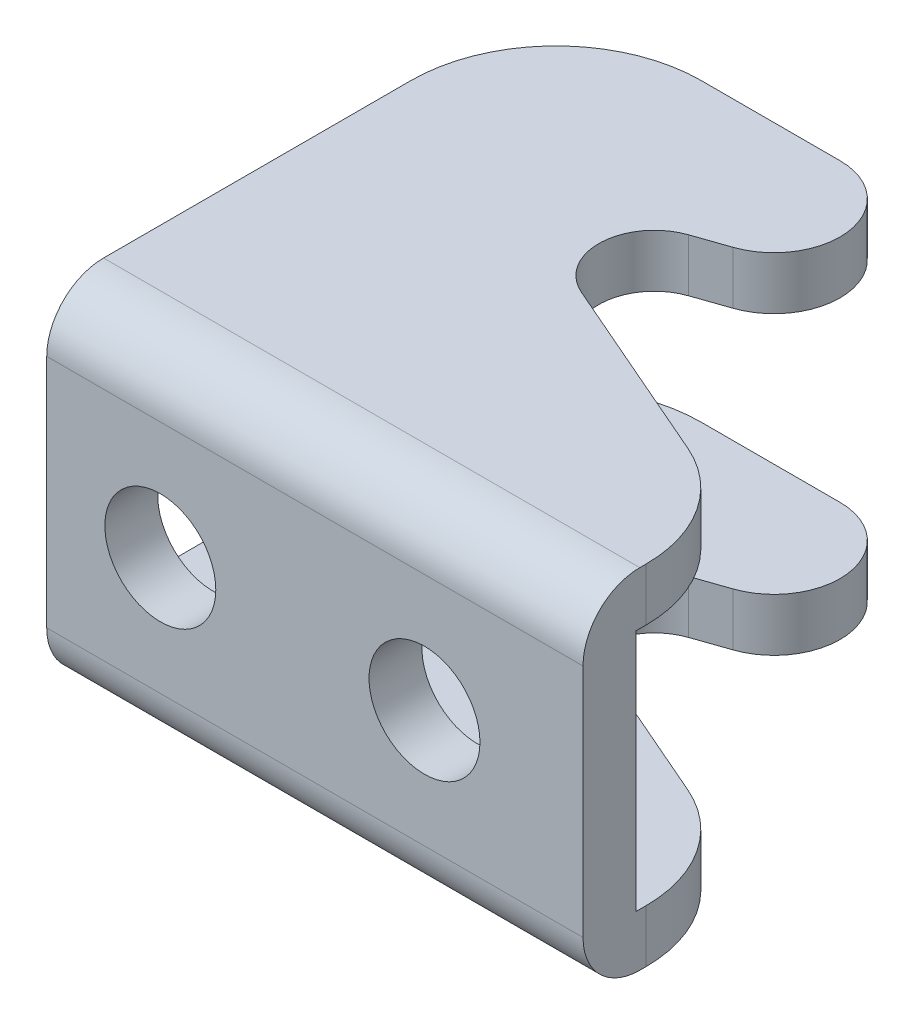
ISO-10303-21;
HEADER;
FILE_DESCRIPTION(('STEP AP214'),'2;1');
FILE_NAME('part.step','',(''),(''),'','','');
FILE_SCHEMA(('AUTOMOTIVE_DESIGN { 1 0 10303 214 1 1 1 1 }'));
ENDSEC;
DATA;
#1=APPLICATION_CONTEXT('core data for automotive mechanical design processes');
#2=APPLICATION_PROTOCOL_DEFINITION('international standard','automotive_design',2000,#1);
#3=PRODUCT_CONTEXT('',#1,'mechanical');
#4=PRODUCT('Part','Part','',(#3));
#5=PRODUCT_RELATED_PRODUCT_CATEGORY('part','',(#4));
#6=PRODUCT_DEFINITION_FORMATION('','',#4);
#7=PRODUCT_DEFINITION_CONTEXT('part definition',#1,'design');
#8=PRODUCT_DEFINITION('design','',#6,#7);
#9=PRODUCT_DEFINITION_SHAPE('','',#8);
#10=(LENGTH_UNIT() NAMED_UNIT(*) SI_UNIT(.MILLI.,.METRE.));
#11=(NAMED_UNIT(*) PLANE_ANGLE_UNIT() SI_UNIT($,.RADIAN.));
#12=(NAMED_UNIT(*) SI_UNIT($,.STERADIAN.) SOLID_ANGLE_UNIT());
#13=UNCERTAINTY_MEASURE_WITH_UNIT(LENGTH_MEASURE(1.E-05),#10,'distance_accuracy_value','');
#14=(GEOMETRIC_REPRESENTATION_CONTEXT(3) GLOBAL_UNCERTAINTY_ASSIGNED_CONTEXT((#13)) GLOBAL_UNIT_ASSIGNED_CONTEXT((#10,
#11,#12)) REPRESENTATION_CONTEXT('',''));
#15=CARTESIAN_POINT('',(0.,0.,0.));
#16=DIRECTION('',(0.,0.,1.));
#17=DIRECTION('',(1.,0.,0.));
#18=AXIS2_PLACEMENT_3D('',#15,#16,#17);
#19=CARTESIAN_POINT('',(6.01410903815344,6.60000000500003,-13.9848308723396));
#20=DIRECTION('',(-0.326614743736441,0.,-0.945157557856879));
#21=DIRECTION('',(0.945157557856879,0.,-0.326614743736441));
#22=AXIS2_PLACEMENT_3D('',#19,#20,#21);
#23=PLANE('',#22);
#24=DIRECTION('',(0.,-1.,0.));
#25=VECTOR('',#24,1.);
#26=CARTESIAN_POINT('',(7.2665368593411,6.60000000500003,-14.4176279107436));
#27=LINE('',#26,#25);
#28=CARTESIAN_POINT('',(7.2665368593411,6.60000000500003,-14.4176279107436));
#29=VERTEX_POINT('',#28);
#30=CARTESIAN_POINT('',(7.2665368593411,4.60000000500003,-14.4176279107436));
#31=VERTEX_POINT('',#30);
#32=EDGE_CURVE('E241',#29,#31,#27,.T.);
#33=ORIENTED_EDGE('',*,*,#32,.F.);
#34=DIRECTION('',(0.945157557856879,0.,-0.326614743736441));
#35=VECTOR('',#34,1.);
#36=CARTESIAN_POINT('',(6.01410903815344,6.60000000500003,-13.9848308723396));
#37=LINE('',#36,#35);
#38=CARTESIAN_POINT('',(6.01410903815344,6.60000000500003,-13.9848308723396));
#39=VERTEX_POINT('',#38);
#40=EDGE_CURVE('E259',#39,#29,#37,.T.);
#41=ORIENTED_EDGE('',*,*,#40,.F.);
#42=DIRECTION('',(0.,-1.,0.));
#43=VECTOR('',#42,1.);
#44=CARTESIAN_POINT('',(6.01410903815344,6.60000000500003,-13.9848308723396));
#45=LINE('',#44,#43);
#46=CARTESIAN_POINT('',(6.01410903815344,4.60000000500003,-13.9848308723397));
#47=VERTEX_POINT('',#46);
#48=EDGE_CURVE('E247',#39,#47,#45,.T.);
#49=ORIENTED_EDGE('',*,*,#48,.T.);
#50=DIRECTION('',(0.945157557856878,0.,-0.326614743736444));
#51=VECTOR('',#50,1.);
#52=CARTESIAN_POINT('',(6.01410903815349,4.60000000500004,-13.9848308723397));
#53=LINE('',#52,#51);
#54=EDGE_CURVE('E256',#47,#31,#53,.T.);
#55=ORIENTED_EDGE('',*,*,#54,.T.);
#56=EDGE_LOOP('',(#33,#41,#49,#55));
#57=FACE_BOUND('',#56,.T.);
#58=ADVANCED_FACE('F14',(#57),#23,.F.);
#59=CARTESIAN_POINT('',(1.20000000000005,4.60000000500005,-13.7805218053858));
#60=DIRECTION('',(0.,1.,0.));
#61=DIRECTION('',(1.,0.,0.));
#62=AXIS2_PLACEMENT_3D('',#59,#60,#61);
#63=PLANE('',#62);
#64=DIRECTION('',(0.,0.,-1.));
#65=VECTOR('',#64,1.);
#66=CARTESIAN_POINT('',(-4.3,4.60000000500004,-13.7805218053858));
#67=LINE('',#66,#65);
#68=CARTESIAN_POINT('',(-4.3,4.60000000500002,-2.));
#69=VERTEX_POINT('',#68);
#70=CARTESIAN_POINT('',(-4.3,4.60000000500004,-13.7805218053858));
#71=VERTEX_POINT('',#70);
#72=EDGE_CURVE('E168',#69,#71,#67,.T.);
#73=ORIENTED_EDGE('',*,*,#72,.T.);
#74=CARTESIAN_POINT('',(1.20000000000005,4.60000000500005,-13.7805218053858));
#75=DIRECTION('',(0.,-1.,0.));
#76=DIRECTION('',(-1.,0.,0.));
#77=AXIS2_PLACEMENT_3D('',#74,#75,#76);
#78=CIRCLE('',#77,5.5);
#79=CARTESIAN_POINT('',(1.20000000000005,4.60000000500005,-19.2805218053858));
#80=VERTEX_POINT('',#79);
#81=EDGE_CURVE('E236',#80,#71,#78,.F.);
#82=ORIENTED_EDGE('',*,*,#81,.F.);
#83=DIRECTION('',(-1.,0.,0.));
#84=VECTOR('',#83,1.);
#85=CARTESIAN_POINT('',(6.45,4.60000000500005,-19.2805218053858));
#86=LINE('',#85,#84);
#87=CARTESIAN_POINT('',(6.45,4.60000000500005,-19.2805218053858));
#88=VERTEX_POINT('',#87);
#89=EDGE_CURVE('E239',#80,#88,#86,.F.);
#90=ORIENTED_EDGE('',*,*,#89,.T.);
#91=CARTESIAN_POINT('',(6.45,4.60000000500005,-16.7805218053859));
#92=DIRECTION('',(0.,-1.,0.));
#93=DIRECTION('',(-1.,0.,0.));
#94=AXIS2_PLACEMENT_3D('',#91,#92,#93);
#95=CIRCLE('',#94,2.5);
#96=EDGE_CURVE('E240',#31,#88,#95,.F.);
#97=ORIENTED_EDGE('',*,*,#96,.F.);
#98=ORIENTED_EDGE('',*,*,#54,.F.);
#99=CARTESIAN_POINT('',(6.7,4.60000000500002,-12.0000000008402));
#100=DIRECTION('',(0.,-1.,0.));
#101=DIRECTION('',(-1.,0.,0.));
#102=AXIS2_PLACEMENT_3D('',#99,#100,#101);
#103=CIRCLE('',#102,2.1);
#104=CARTESIAN_POINT('',(5.86267460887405,4.60000000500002,-10.0741531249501));
#105=VERTEX_POINT('',#104);
#106=EDGE_CURVE('E244',#47,#105,#103,.F.);
#107=ORIENTED_EDGE('',*,*,#106,.T.);
#108=DIRECTION('',(-0.917069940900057,0.,-0.398726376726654));
#109=VECTOR('',#108,1.);
#110=CARTESIAN_POINT('',(12.9936318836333,4.60000000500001,-6.97373446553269));
#111=LINE('',#110,#109);
#112=CARTESIAN_POINT('',(12.9936318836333,4.60000000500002,-6.97373446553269));
#113=VERTEX_POINT('',#112);
#114=EDGE_CURVE('E248',#105,#113,#111,.F.);
#115=ORIENTED_EDGE('',*,*,#114,.T.);
#116=CARTESIAN_POINT('',(11.0000000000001,4.60000000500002,-2.38838476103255));
#117=DIRECTION('',(0.,-1.,0.));
#118=DIRECTION('',(-1.,0.,0.));
#119=AXIS2_PLACEMENT_3D('',#116,#117,#118);
#120=CIRCLE('',#119,4.99999999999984);
#121=CARTESIAN_POINT('',(16.,4.60000000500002,-2.38838476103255));
#122=VERTEX_POINT('',#121);
#123=EDGE_CURVE('E252',#122,#113,#120,.F.);
#124=ORIENTED_EDGE('',*,*,#123,.F.);
#125=DIRECTION('',(0.,0.,-1.));
#126=VECTOR('',#125,1.);
#127=CARTESIAN_POINT('',(16.,4.60000000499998,9.52400421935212));
#128=LINE('',#127,#126);
#129=CARTESIAN_POINT('',(16.,4.60000000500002,-2.));
#130=VERTEX_POINT('',#129);
#131=EDGE_CURVE('E229',#122,#130,#128,.F.);
#132=ORIENTED_EDGE('',*,*,#131,.T.);
#133=DIRECTION('',(-1.,0.,0.));
#134=VECTOR('',#133,1.);
#135=CARTESIAN_POINT('',(1.20000000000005,4.60000000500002,-2.));
#136=LINE('',#135,#134);
#137=EDGE_CURVE('E307',#130,#69,#136,.T.);
#138=ORIENTED_EDGE('',*,*,#137,.T.);
#139=EDGE_LOOP('',(#73,#82,#90,#97,#98,#107,#115,#124,#132,#138));
#140=FACE_BOUND('',#139,.T.);
#141=ADVANCED_FACE('F322',(#140),#63,.F.);
#142=CARTESIAN_POINT('',(11.0000000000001,6.60000000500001,-2.38838476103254));
#143=DIRECTION('',(0.,-1.,0.));
#144=DIRECTION('',(-1.,0.,0.));
#145=AXIS2_PLACEMENT_3D('',#142,#143,#144);
#146=CYLINDRICAL_SURFACE('',#145,4.99999999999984);
#147=CARTESIAN_POINT('',(11.0000000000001,6.60000000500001,-2.38838476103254));
#148=DIRECTION('',(0.,-1.,0.));
#149=DIRECTION('',(-1.,0.,0.));
#150=AXIS2_PLACEMENT_3D('',#147,#148,#149);
#151=CIRCLE('',#150,4.99999999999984);
#152=CARTESIAN_POINT('',(16.,6.60000000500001,-2.38838476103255));
#153=VERTEX_POINT('',#152);
#154=CARTESIAN_POINT('',(12.9936318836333,6.60000000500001,-6.97373446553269));
#155=VERTEX_POINT('',#154);
#156=EDGE_CURVE('E221',#153,#155,#151,.F.);
#157=ORIENTED_EDGE('',*,*,#156,.F.);
#158=DIRECTION('',(0.,1.,0.));
#159=VECTOR('',#158,1.);
#160=CARTESIAN_POINT('',(16.,6.60000000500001,-2.38838476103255));
#161=LINE('',#160,#159);
#162=EDGE_CURVE('E232',#153,#122,#161,.F.);
#163=ORIENTED_EDGE('',*,*,#162,.T.);
#164=ORIENTED_EDGE('',*,*,#123,.T.);
#165=DIRECTION('',(0.,-1.,0.));
#166=VECTOR('',#165,1.);
#167=CARTESIAN_POINT('',(12.9936318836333,6.60000000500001,-6.97373446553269));
#168=LINE('',#167,#166);
#169=EDGE_CURVE('E250',#113,#155,#168,.F.);
#170=ORIENTED_EDGE('',*,*,#169,.T.);
#171=EDGE_LOOP('',(#157,#163,#164,#170));
#172=FACE_BOUND('',#171,.T.);
#173=ADVANCED_FACE('F586',(#172),#146,.T.);
#174=CARTESIAN_POINT('',(12.9936318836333,6.60000000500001,-6.97373446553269));
#175=DIRECTION('',(-0.398726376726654,0.,0.917069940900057));
#176=DIRECTION('',(-0.917069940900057,0.,-0.398726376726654));
#177=AXIS2_PLACEMENT_3D('',#174,#175,#176);
#178=PLANE('',#177);
#179=DIRECTION('',(0.,-1.,0.));
#180=VECTOR('',#179,1.);
#181=CARTESIAN_POINT('',(5.86267460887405,6.60000000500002,-10.0741531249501));
#182=LINE('',#181,#180);
#183=CARTESIAN_POINT('',(5.86267460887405,6.60000000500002,-10.0741531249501));
#184=VERTEX_POINT('',#183);
#185=EDGE_CURVE('E245',#105,#184,#182,.F.);
#186=ORIENTED_EDGE('',*,*,#185,.T.);
#187=DIRECTION('',(-0.917069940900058,0.,-0.398726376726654));
#188=VECTOR('',#187,1.);
#189=CARTESIAN_POINT('',(12.9936318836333,6.60000000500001,-6.97373446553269));
#190=LINE('',#189,#188);
#191=EDGE_CURVE('E217',#155,#184,#190,.T.);
#192=ORIENTED_EDGE('',*,*,#191,.F.);
#193=ORIENTED_EDGE('',*,*,#169,.F.);
#194=ORIENTED_EDGE('',*,*,#114,.F.);
#195=EDGE_LOOP('',(#186,#192,#193,#194));
#196=FACE_BOUND('',#195,.T.);
#197=ADVANCED_FACE('F577',(#196),#178,.F.);
#198=CARTESIAN_POINT('',(6.7,6.60000000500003,-12.0000000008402));
#199=DIRECTION('',(0.,-1.,0.));
#200=DIRECTION('',(-1.,0.,0.));
#201=AXIS2_PLACEMENT_3D('',#198,#199,#200);
#202=CYLINDRICAL_SURFACE('',#201,2.1);
#203=ORIENTED_EDGE('',*,*,#48,.F.);
#204=CARTESIAN_POINT('',(6.7,6.60000000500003,-12.0000000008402));
#205=DIRECTION('',(0.,-1.,0.));
#206=DIRECTION('',(-1.,0.,0.));
#207=AXIS2_PLACEMENT_3D('',#204,#205,#206);
#208=CIRCLE('',#207,2.1);
#209=EDGE_CURVE('E220',#184,#39,#208,.T.);
#210=ORIENTED_EDGE('',*,*,#209,.F.);
#211=ORIENTED_EDGE('',*,*,#185,.F.);
#212=ORIENTED_EDGE('',*,*,#106,.F.);
#213=EDGE_LOOP('',(#203,#210,#211,#212));
#214=FACE_BOUND('',#213,.T.);
#215=ADVANCED_FACE('F568',(#214),#202,.F.);
#216=CARTESIAN_POINT('',(6.45,6.60000000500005,-16.7805218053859));
#217=DIRECTION('',(0.,-1.,0.));
#218=DIRECTION('',(-1.,0.,0.));
#219=AXIS2_PLACEMENT_3D('',#216,#217,#218);
#220=CYLINDRICAL_SURFACE('',#219,2.5);
#221=ORIENTED_EDGE('',*,*,#96,.T.);
#222=DIRECTION('',(0.,-1.,0.));
#223=VECTOR('',#222,1.);
#224=CARTESIAN_POINT('',(6.45,6.60000000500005,-19.2805218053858));
#225=LINE('',#224,#223);
#226=CARTESIAN_POINT('',(6.45,6.60000000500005,-19.2805218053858));
#227=VERTEX_POINT('',#226);
#228=EDGE_CURVE('E237',#88,#227,#225,.F.);
#229=ORIENTED_EDGE('',*,*,#228,.T.);
#230=CARTESIAN_POINT('',(6.45,6.60000000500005,-16.7805218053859));
#231=DIRECTION('',(0.,-1.,0.));
#232=DIRECTION('',(-1.,0.,0.));
#233=AXIS2_PLACEMENT_3D('',#230,#231,#232);
#234=CIRCLE('',#233,2.5);
#235=EDGE_CURVE('E216',#29,#227,#234,.F.);
#236=ORIENTED_EDGE('',*,*,#235,.F.);
#237=ORIENTED_EDGE('',*,*,#32,.T.);
#238=EDGE_LOOP('',(#221,#229,#236,#237));
#239=FACE_BOUND('',#238,.T.);
#240=ADVANCED_FACE('F559',(#239),#220,.T.);
#241=CARTESIAN_POINT('',(6.45,6.60000000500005,-19.2805218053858));
#242=DIRECTION('',(0.,0.,1.));
#243=DIRECTION('',(-1.,0.,0.));
#244=AXIS2_PLACEMENT_3D('',#241,#242,#243);
#245=PLANE('',#244);
#246=DIRECTION('',(0.,-1.,0.));
#247=VECTOR('',#246,1.);
#248=CARTESIAN_POINT('',(1.20000000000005,6.60000000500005,-19.2805218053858));
#249=LINE('',#248,#247);
#250=CARTESIAN_POINT('',(1.20000000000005,6.60000000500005,-19.2805218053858));
#251=VERTEX_POINT('',#250);
#252=EDGE_CURVE('E233',#251,#80,#249,.T.);
#253=ORIENTED_EDGE('',*,*,#252,.F.);
#254=DIRECTION('',(1.,0.,0.));
#255=VECTOR('',#254,1.);
#256=CARTESIAN_POINT('',(1.20000000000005,6.60000000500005,-19.2805218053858));
#257=LINE('',#256,#255);
#258=EDGE_CURVE('E212',#227,#251,#257,.F.);
#259=ORIENTED_EDGE('',*,*,#258,.F.);
#260=ORIENTED_EDGE('',*,*,#228,.F.);
#261=ORIENTED_EDGE('',*,*,#89,.F.);
#262=EDGE_LOOP('',(#253,#259,#260,#261));
#263=FACE_BOUND('',#262,.T.);
#264=ADVANCED_FACE('F550',(#263),#245,.F.);
#265=CARTESIAN_POINT('',(1.20000000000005,6.60000000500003,-13.7805218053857));
#266=DIRECTION('',(0.,-1.,0.));
#267=DIRECTION('',(-1.,0.,0.));
#268=AXIS2_PLACEMENT_3D('',#265,#266,#267);
#269=CYLINDRICAL_SURFACE('',#268,5.5);
#270=CARTESIAN_POINT('',(1.20000000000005,6.60000000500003,-13.7805218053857));
#271=DIRECTION('',(0.,-1.,0.));
#272=DIRECTION('',(-1.,0.,0.));
#273=AXIS2_PLACEMENT_3D('',#270,#271,#272);
#274=CIRCLE('',#273,5.5);
#275=CARTESIAN_POINT('',(-4.3,6.60000000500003,-13.7805218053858));
#276=VERTEX_POINT('',#275);
#277=EDGE_CURVE('E215',#251,#276,#274,.F.);
#278=ORIENTED_EDGE('',*,*,#277,.F.);
#279=ORIENTED_EDGE('',*,*,#252,.T.);
#280=ORIENTED_EDGE('',*,*,#81,.T.);
#281=DIRECTION('',(0.,-1.,0.));
#282=VECTOR('',#281,1.);
#283=CARTESIAN_POINT('',(-4.3,6.60000000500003,-13.7805218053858));
#284=LINE('',#283,#282);
#285=EDGE_CURVE('E227',#71,#276,#284,.F.);
#286=ORIENTED_EDGE('',*,*,#285,.T.);
#287=EDGE_LOOP('',(#278,#279,#280,#286));
#288=FACE_BOUND('',#287,.T.);
#289=ADVANCED_FACE('F541',(#288),#269,.T.);
#290=CARTESIAN_POINT('',(1.20000000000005,6.60000000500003,-13.7805218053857));
#291=DIRECTION('',(0.,1.,0.));
#292=DIRECTION('',(1.,0.,0.));
#293=AXIS2_PLACEMENT_3D('',#290,#291,#292);
#294=PLANE('',#293);
#295=ORIENTED_EDGE('',*,*,#258,.T.);
#296=ORIENTED_EDGE('',*,*,#277,.T.);
#297=DIRECTION('',(0.,0.,-1.));
#298=VECTOR('',#297,1.);
#299=CARTESIAN_POINT('',(-4.3,6.60000000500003,-13.7805218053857));
#300=LINE('',#299,#298);
#301=CARTESIAN_POINT('',(-4.3,6.60000000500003,-2.15));
#302=VERTEX_POINT('',#301);
#303=EDGE_CURVE('E225',#276,#302,#300,.F.);
#304=ORIENTED_EDGE('',*,*,#303,.T.);
#305=DIRECTION('',(-1.,0.,0.));
#306=VECTOR('',#305,1.);
#307=CARTESIAN_POINT('',(26.2876452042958,6.60000000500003,-2.15));
#308=LINE('',#307,#306);
#309=CARTESIAN_POINT('',(16.,6.60000000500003,-2.15));
#310=VERTEX_POINT('',#309);
#311=EDGE_CURVE('E208',#310,#302,#308,.T.);
#312=ORIENTED_EDGE('',*,*,#311,.F.);
#313=DIRECTION('',(0.,0.,-1.));
#314=VECTOR('',#313,1.);
#315=CARTESIAN_POINT('',(16.,6.60000000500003,-13.7805218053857));
#316=LINE('',#315,#314);
#317=EDGE_CURVE('E222',#310,#153,#316,.T.);
#318=ORIENTED_EDGE('',*,*,#317,.T.);
#319=ORIENTED_EDGE('',*,*,#156,.T.);
#320=ORIENTED_EDGE('',*,*,#191,.T.);
#321=ORIENTED_EDGE('',*,*,#209,.T.);
#322=ORIENTED_EDGE('',*,*,#40,.T.);
#323=ORIENTED_EDGE('',*,*,#235,.T.);
#324=EDGE_LOOP('',(#295,#296,#304,#312,#318,#319,#320,#321,#322,#323));
#325=FACE_BOUND('',#324,.T.);
#326=ADVANCED_FACE('F533',(#325),#294,.T.);
#327=CARTESIAN_POINT('',(1.20000000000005,17.3483315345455,-1.99999999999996));
#328=DIRECTION('',(0.,0.,1.));
#329=DIRECTION('',(-1.,0.,0.));
#330=AXIS2_PLACEMENT_3D('',#327,#328,#329);
#331=PLANE('',#330);
#332=ORIENTED_EDGE('',*,*,#137,.F.);
#333=DIRECTION('',(0.,1.,0.));
#334=VECTOR('',#333,1.);
#335=CARTESIAN_POINT('',(16.,-5.95619449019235,-2.00000000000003));
#336=LINE('',#335,#334);
#337=CARTESIAN_POINT('',(16.,-4.60000000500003,-2.));
#338=VERTEX_POINT('',#337);
#339=EDGE_CURVE('E178',#130,#338,#336,.F.);
#340=ORIENTED_EDGE('',*,*,#339,.T.);
#341=DIRECTION('',(-1.,0.,0.));
#342=VECTOR('',#341,1.);
#343=CARTESIAN_POINT('',(1.20000000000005,-4.60000000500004,-2.));
#344=LINE('',#343,#342);
#345=CARTESIAN_POINT('',(-4.3,-4.60000000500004,-2.));
#346=VERTEX_POINT('',#345);
#347=EDGE_CURVE('E17',#338,#346,#344,.T.);
#348=ORIENTED_EDGE('',*,*,#347,.T.);
#349=DIRECTION('',(0.,-1.,0.));
#350=VECTOR('',#349,1.);
#351=CARTESIAN_POINT('',(-4.3,17.3483315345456,-1.99999999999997));
#352=LINE('',#351,#350);
#353=EDGE_CURVE('E160',#346,#69,#352,.F.);
#354=ORIENTED_EDGE('',*,*,#353,.T.);
#355=EDGE_LOOP('',(#332,#340,#348,#354));
#356=FACE_BOUND('',#355,.T.);
#357=CARTESIAN_POINT('',(10.,0.,-2.));
#358=DIRECTION('',(0.,0.,-1.));
#359=DIRECTION('',(1.,0.,0.));
#360=AXIS2_PLACEMENT_3D('',#357,#358,#359);
#361=CIRCLE('',#360,2.1);
#362=CARTESIAN_POINT('',(12.1,0.,-2.));
#363=VERTEX_POINT('',#362);
#364=EDGE_CURVE('E172',#363,#363,#361,.F.);
#365=ORIENTED_EDGE('',*,*,#364,.T.);
#366=EDGE_LOOP('',(#365));
#367=FACE_BOUND('',#366,.T.);
#368=CARTESIAN_POINT('',(0.,0.,-2.));
#369=DIRECTION('',(0.,0.,-1.));
#370=DIRECTION('',(1.,0.,0.));
#371=AXIS2_PLACEMENT_3D('',#368,#369,#370);
#372=CIRCLE('',#371,2.1);
#373=CARTESIAN_POINT('',(2.1,0.,-2.));
#374=VERTEX_POINT('',#373);
#375=EDGE_CURVE('E206',#374,#374,#372,.F.);
#376=ORIENTED_EDGE('',*,*,#375,.T.);
#377=EDGE_LOOP('',(#376));
#378=FACE_BOUND('',#377,.T.);
#379=ADVANCED_FACE('F176',(#356,#367,#378),#331,.F.);
#380=CARTESIAN_POINT('',(26.2876452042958,4.45000000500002,-2.15));
#381=DIRECTION('',(-1.,0.,0.));
#382=DIRECTION('',(0.,1.,0.));
#383=AXIS2_PLACEMENT_3D('',#380,#381,#382);
#384=CYLINDRICAL_SURFACE('',#383,2.15);
#385=ORIENTED_EDGE('',*,*,#311,.T.);
#386=CARTESIAN_POINT('',(-4.3,4.45000000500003,-2.15));
#387=DIRECTION('',(-1.,0.,0.));
#388=DIRECTION('',(0.,1.,0.));
#389=AXIS2_PLACEMENT_3D('',#386,#387,#388);
#390=CIRCLE('',#389,2.15);
#391=CARTESIAN_POINT('',(-4.3,4.45000000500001,0.));
#392=VERTEX_POINT('',#391);
#393=EDGE_CURVE('E207',#302,#392,#390,.F.);
#394=ORIENTED_EDGE('',*,*,#393,.T.);
#395=DIRECTION('',(-1.,0.,0.));
#396=VECTOR('',#395,1.);
#397=CARTESIAN_POINT('',(1.20000000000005,4.45000000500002,0.));
#398=LINE('',#397,#396);
#399=CARTESIAN_POINT('',(16.,4.45000000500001,0.));
#400=VERTEX_POINT('',#399);
#401=EDGE_CURVE('E180',#400,#392,#398,.T.);
#402=ORIENTED_EDGE('',*,*,#401,.F.);
#403=CARTESIAN_POINT('',(16.,4.45000000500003,-2.15));
#404=DIRECTION('',(-1.,0.,0.));
#405=DIRECTION('',(0.,1.,0.));
#406=AXIS2_PLACEMENT_3D('',#403,#404,#405);
#407=CIRCLE('',#406,2.15);
#408=EDGE_CURVE('E211',#400,#310,#407,.T.);
#409=ORIENTED_EDGE('',*,*,#408,.T.);
#410=EDGE_LOOP('',(#385,#394,#402,#409));
#411=FACE_BOUND('',#410,.T.);
#412=ADVANCED_FACE('F516',(#411),#384,.T.);
#413=CARTESIAN_POINT('',(0.,0.,-2.));
#414=DIRECTION('',(0.,0.,-1.));
#415=DIRECTION('',(1.,0.,0.));
#416=AXIS2_PLACEMENT_3D('',#413,#414,#415);
#417=CYLINDRICAL_SURFACE('',#416,2.1);
#418=CARTESIAN_POINT('',(0.,0.,0.));
#419=DIRECTION('',(0.,0.,-1.));
#420=DIRECTION('',(1.,0.,0.));
#421=AXIS2_PLACEMENT_3D('',#418,#419,#420);
#422=CIRCLE('',#421,2.1);
#423=CARTESIAN_POINT('',(2.1,0.,0.));
#424=VERTEX_POINT('',#423);
#425=EDGE_CURVE('E201',#424,#424,#422,.T.);
#426=ORIENTED_EDGE('',*,*,#425,.F.);
#427=EDGE_LOOP('',(#426));
#428=FACE_BOUND('',#427,.T.);
#429=ORIENTED_EDGE('',*,*,#375,.F.);
#430=EDGE_LOOP('',(#429));
#431=FACE_BOUND('',#430,.T.);
#432=ADVANCED_FACE('F507',(#428,#431),#417,.F.);
#433=CARTESIAN_POINT('',(10.,0.,-2.));
#434=DIRECTION('',(0.,0.,-1.));
#435=DIRECTION('',(1.,0.,0.));
#436=AXIS2_PLACEMENT_3D('',#433,#434,#435);
#437=CYLINDRICAL_SURFACE('',#436,2.1);
#438=CARTESIAN_POINT('',(10.,0.,0.));
#439=DIRECTION('',(0.,0.,-1.));
#440=DIRECTION('',(1.,0.,0.));
#441=AXIS2_PLACEMENT_3D('',#438,#439,#440);
#442=CIRCLE('',#441,2.1);
#443=CARTESIAN_POINT('',(12.1,0.,0.));
#444=VERTEX_POINT('',#443);
#445=EDGE_CURVE('E294',#444,#444,#442,.T.);
#446=ORIENTED_EDGE('',*,*,#445,.F.);
#447=EDGE_LOOP('',(#446));
#448=FACE_BOUND('',#447,.T.);
#449=ORIENTED_EDGE('',*,*,#364,.F.);
#450=EDGE_LOOP('',(#449));
#451=FACE_BOUND('',#450,.T.);
#452=ADVANCED_FACE('F498',(#448,#451),#437,.F.);
#453=CARTESIAN_POINT('',(1.20000000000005,17.3483315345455,0.));
#454=DIRECTION('',(0.,0.,1.));
#455=DIRECTION('',(-1.,0.,0.));
#456=AXIS2_PLACEMENT_3D('',#453,#454,#455);
#457=PLANE('',#456);
#458=ORIENTED_EDGE('',*,*,#445,.T.);
#459=EDGE_LOOP('',(#458));
#460=FACE_BOUND('',#459,.T.);
#461=ORIENTED_EDGE('',*,*,#425,.T.);
#462=EDGE_LOOP('',(#461));
#463=FACE_BOUND('',#462,.T.);
#464=DIRECTION('',(1.,0.,0.));
#465=VECTOR('',#464,1.);
#466=CARTESIAN_POINT('',(-14.5876452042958,-4.45000000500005,0.));
#467=LINE('',#466,#465);
#468=CARTESIAN_POINT('',(16.,-4.45000000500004,0.));
#469=VERTEX_POINT('',#468);
#470=CARTESIAN_POINT('',(-4.3,-4.45000000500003,0.));
#471=VERTEX_POINT('',#470);
#472=EDGE_CURVE('E188',#469,#471,#467,.F.);
#473=ORIENTED_EDGE('',*,*,#472,.F.);
#474=DIRECTION('',(0.,-1.,0.));
#475=VECTOR('',#474,1.);
#476=CARTESIAN_POINT('',(16.,17.3483315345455,0.));
#477=LINE('',#476,#475);
#478=EDGE_CURVE('E199',#469,#400,#477,.F.);
#479=ORIENTED_EDGE('',*,*,#478,.T.);
#480=ORIENTED_EDGE('',*,*,#401,.T.);
#481=DIRECTION('',(0.,-1.,0.));
#482=VECTOR('',#481,1.);
#483=CARTESIAN_POINT('',(-4.3,17.3483315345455,0.));
#484=LINE('',#483,#482);
#485=EDGE_CURVE('E197',#392,#471,#484,.T.);
#486=ORIENTED_EDGE('',*,*,#485,.T.);
#487=EDGE_LOOP('',(#473,#479,#480,#486));
#488=FACE_BOUND('',#487,.T.);
#489=ADVANCED_FACE('F382',(#460,#463,#488),#457,.T.);
#490=CARTESIAN_POINT('',(7.2665368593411,-6.60000000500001,-14.4176279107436));
#491=DIRECTION('',(-0.326614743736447,0.,-0.945157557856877));
#492=DIRECTION('',(0.945157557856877,0.,-0.326614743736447));
#493=AXIS2_PLACEMENT_3D('',#490,#491,#492);
#494=PLANE('',#493);
#495=DIRECTION('',(0.,1.,0.));
#496=VECTOR('',#495,1.);
#497=CARTESIAN_POINT('',(6.01410903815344,-6.60000000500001,-13.9848308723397));
#498=LINE('',#497,#496);
#499=CARTESIAN_POINT('',(6.01410903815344,-4.60000000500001,-13.9848308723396));
#500=VERTEX_POINT('',#499);
#501=CARTESIAN_POINT('',(6.01410903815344,-6.60000000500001,-13.9848308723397));
#502=VERTEX_POINT('',#501);
#503=EDGE_CURVE('E285',#500,#502,#498,.F.);
#504=ORIENTED_EDGE('',*,*,#503,.T.);
#505=DIRECTION('',(0.945157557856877,0.,-0.326614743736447));
#506=VECTOR('',#505,1.);
#507=CARTESIAN_POINT('',(7.2665368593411,-6.60000000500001,-14.4176279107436));
#508=LINE('',#507,#506);
#509=CARTESIAN_POINT('',(7.2665368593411,-6.60000000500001,-14.4176279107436));
#510=VERTEX_POINT('',#509);
#511=EDGE_CURVE('E297',#510,#502,#508,.F.);
#512=ORIENTED_EDGE('',*,*,#511,.F.);
#513=DIRECTION('',(0.,1.,0.));
#514=VECTOR('',#513,1.);
#515=CARTESIAN_POINT('',(7.2665368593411,-6.60000000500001,-14.4176279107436));
#516=LINE('',#515,#514);
#517=CARTESIAN_POINT('',(7.2665368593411,-4.60000000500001,-14.4176279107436));
#518=VERTEX_POINT('',#517);
#519=EDGE_CURVE('E288',#518,#510,#516,.F.);
#520=ORIENTED_EDGE('',*,*,#519,.F.);
#521=DIRECTION('',(-0.945157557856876,0.,0.326614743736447));
#522=VECTOR('',#521,1.);
#523=CARTESIAN_POINT('',(7.2665368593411,-4.60000000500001,-14.4176279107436));
#524=LINE('',#523,#522);
#525=EDGE_CURVE('E328',#518,#500,#524,.T.);
#526=ORIENTED_EDGE('',*,*,#525,.T.);
#527=EDGE_LOOP('',(#504,#512,#520,#526));
#528=FACE_BOUND('',#527,.T.);
#529=ADVANCED_FACE('F344',(#528),#494,.F.);
#530=CARTESIAN_POINT('',(1.20000000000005,-4.60000000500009,20.9161412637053));
#531=DIRECTION('',(0.,-1.,0.));
#532=DIRECTION('',(-1.,0.,0.));
#533=AXIS2_PLACEMENT_3D('',#530,#531,#532);
#534=PLANE('',#533);
#535=ORIENTED_EDGE('',*,*,#347,.F.);
#536=DIRECTION('',(0.,0.,-1.));
#537=VECTOR('',#536,1.);
#538=CARTESIAN_POINT('',(16.,-4.60000000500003,-2.38838476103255));
#539=LINE('',#538,#537);
#540=CARTESIAN_POINT('',(16.,-4.60000000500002,-2.38838476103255));
#541=VERTEX_POINT('',#540);
#542=EDGE_CURVE('E293',#338,#541,#539,.T.);
#543=ORIENTED_EDGE('',*,*,#542,.T.);
#544=CARTESIAN_POINT('',(11.0000000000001,-4.60000000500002,-2.38838476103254));
#545=DIRECTION('',(0.,1.,0.));
#546=DIRECTION('',(1.,0.,0.));
#547=AXIS2_PLACEMENT_3D('',#544,#545,#546);
#548=CIRCLE('',#547,4.99999999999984);
#549=CARTESIAN_POINT('',(12.9936318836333,-4.60000000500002,-6.97373446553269));
#550=VERTEX_POINT('',#549);
#551=EDGE_CURVE('E276',#550,#541,#548,.F.);
#552=ORIENTED_EDGE('',*,*,#551,.F.);
#553=DIRECTION('',(-0.917069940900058,0.,-0.398726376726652));
#554=VECTOR('',#553,1.);
#555=CARTESIAN_POINT('',(5.86267460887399,-4.60000000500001,-10.0741531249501));
#556=LINE('',#555,#554);
#557=CARTESIAN_POINT('',(5.86267460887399,-4.60000000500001,-10.0741531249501));
#558=VERTEX_POINT('',#557);
#559=EDGE_CURVE('E280',#550,#558,#556,.T.);
#560=ORIENTED_EDGE('',*,*,#559,.T.);
#561=CARTESIAN_POINT('',(6.7,-4.60000000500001,-12.0000000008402));
#562=DIRECTION('',(0.,1.,0.));
#563=DIRECTION('',(1.,0.,0.));
#564=AXIS2_PLACEMENT_3D('',#561,#562,#563);
#565=CIRCLE('',#564,2.1);
#566=EDGE_CURVE('E281',#558,#500,#565,.F.);
#567=ORIENTED_EDGE('',*,*,#566,.T.);
#568=ORIENTED_EDGE('',*,*,#525,.F.);
#569=CARTESIAN_POINT('',(6.45,-4.60000000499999,-16.7805218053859));
#570=DIRECTION('',(0.,1.,0.));
#571=DIRECTION('',(1.,0.,0.));
#572=AXIS2_PLACEMENT_3D('',#569,#570,#571);
#573=CIRCLE('',#572,2.5);
#574=CARTESIAN_POINT('',(6.45,-4.600000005,-19.2805218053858));
#575=VERTEX_POINT('',#574);
#576=EDGE_CURVE('E286',#575,#518,#573,.F.);
#577=ORIENTED_EDGE('',*,*,#576,.F.);
#578=DIRECTION('',(-1.,0.,0.));
#579=VECTOR('',#578,1.);
#580=CARTESIAN_POINT('',(1.2,-4.60000000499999,-19.2805218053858));
#581=LINE('',#580,#579);
#582=CARTESIAN_POINT('',(1.20000000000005,-4.600000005,-19.2805218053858));
#583=VERTEX_POINT('',#582);
#584=EDGE_CURVE('E192',#575,#583,#581,.T.);
#585=ORIENTED_EDGE('',*,*,#584,.T.);
#586=CARTESIAN_POINT('',(1.2,-4.60000000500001,-13.7805218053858));
#587=DIRECTION('',(0.,1.,0.));
#588=DIRECTION('',(1.,0.,0.));
#589=AXIS2_PLACEMENT_3D('',#586,#587,#588);
#590=CIRCLE('',#589,5.5);
#591=CARTESIAN_POINT('',(-4.3,-4.60000000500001,-13.7805218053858));
#592=VERTEX_POINT('',#591);
#593=EDGE_CURVE('E183',#592,#583,#590,.F.);
#594=ORIENTED_EDGE('',*,*,#593,.F.);
#595=DIRECTION('',(0.,0.,-1.));
#596=VECTOR('',#595,1.);
#597=CARTESIAN_POINT('',(-4.3,-4.6000000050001,20.9161412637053));
#598=LINE('',#597,#596);
#599=EDGE_CURVE('E165',#592,#346,#598,.F.);
#600=ORIENTED_EDGE('',*,*,#599,.T.);
#601=EDGE_LOOP('',(#535,#543,#552,#560,#567,#568,#577,#585,#594,#600));
#602=FACE_BOUND('',#601,.T.);
#603=ADVANCED_FACE('F181',(#602),#534,.F.);
#604=CARTESIAN_POINT('',(16.,-6.60000000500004,-2.38838476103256));
#605=DIRECTION('',(-1.,0.,0.));
#606=DIRECTION('',(0.,1.,0.));
#607=AXIS2_PLACEMENT_3D('',#604,#605,#606);
#608=PLANE('',#607);
#609=ORIENTED_EDGE('',*,*,#542,.F.);
#610=ORIENTED_EDGE('',*,*,#339,.F.);
#611=ORIENTED_EDGE('',*,*,#131,.F.);
#612=ORIENTED_EDGE('',*,*,#162,.F.);
#613=ORIENTED_EDGE('',*,*,#317,.F.);
#614=ORIENTED_EDGE('',*,*,#408,.F.);
#615=ORIENTED_EDGE('',*,*,#478,.F.);
#616=CARTESIAN_POINT('',(16.,-4.450000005,-2.15));
#617=DIRECTION('',(1.,0.,0.));
#618=DIRECTION('',(0.,-1.,0.));
#619=AXIS2_PLACEMENT_3D('',#616,#617,#618);
#620=CIRCLE('',#619,2.15);
#621=CARTESIAN_POINT('',(16.,-6.600000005,-2.15));
#622=VERTEX_POINT('',#621);
#623=EDGE_CURVE('E196',#622,#469,#620,.F.);
#624=ORIENTED_EDGE('',*,*,#623,.F.);
#625=DIRECTION('',(0.,0.,-1.));
#626=VECTOR('',#625,1.);
#627=CARTESIAN_POINT('',(16.,-6.60000000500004,-2.38838476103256));
#628=LINE('',#627,#626);
#629=CARTESIAN_POINT('',(16.,-6.60000000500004,-2.38838476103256));
#630=VERTEX_POINT('',#629);
#631=EDGE_CURVE('E32',#630,#622,#628,.F.);
#632=ORIENTED_EDGE('',*,*,#631,.F.);
#633=DIRECTION('',(0.,1.,0.));
#634=VECTOR('',#633,1.);
#635=CARTESIAN_POINT('',(16.,-6.60000000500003,-2.38838476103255));
#636=LINE('',#635,#634);
#637=EDGE_CURVE('E279',#541,#630,#636,.F.);
#638=ORIENTED_EDGE('',*,*,#637,.F.);
#639=EDGE_LOOP('',(#609,#610,#611,#612,#613,#614,#615,#624,#632,#638));
#640=FACE_BOUND('',#639,.T.);
#641=ADVANCED_FACE('F325',(#640),#608,.F.);
#642=CARTESIAN_POINT('',(-14.5876452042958,-4.450000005,-2.15));
#643=DIRECTION('',(1.,0.,0.));
#644=DIRECTION('',(0.,-1.,0.));
#645=AXIS2_PLACEMENT_3D('',#642,#643,#644);
#646=CYLINDRICAL_SURFACE('',#645,2.15);
#647=CARTESIAN_POINT('',(-4.3,-4.450000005,-2.15000000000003));
#648=DIRECTION('',(1.,0.,0.));
#649=DIRECTION('',(0.,-1.,0.));
#650=AXIS2_PLACEMENT_3D('',#647,#648,#649);
#651=CIRCLE('',#650,2.15);
#652=CARTESIAN_POINT('',(-4.3,-6.60000000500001,-2.15));
#653=VERTEX_POINT('',#652);
#654=EDGE_CURVE('E184',#471,#653,#651,.T.);
#655=ORIENTED_EDGE('',*,*,#654,.T.);
#656=DIRECTION('',(-1.,0.,0.));
#657=VECTOR('',#656,1.);
#658=CARTESIAN_POINT('',(1.20000000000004,-6.60000000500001,-2.15));
#659=LINE('',#658,#657);
#660=EDGE_CURVE('E363',#622,#653,#659,.T.);
#661=ORIENTED_EDGE('',*,*,#660,.F.);
#662=ORIENTED_EDGE('',*,*,#623,.T.);
#663=ORIENTED_EDGE('',*,*,#472,.T.);
#664=EDGE_LOOP('',(#655,#661,#662,#663));
#665=FACE_BOUND('',#664,.T.);
#666=ADVANCED_FACE('F377',(#665),#646,.T.);
#667=CARTESIAN_POINT('',(-4.3,-6.6000000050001,20.9161412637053));
#668=DIRECTION('',(1.,0.,0.));
#669=DIRECTION('',(0.,-1.,0.));
#670=AXIS2_PLACEMENT_3D('',#667,#668,#669);
#671=PLANE('',#670);
#672=DIRECTION('',(0.,0.,-1.));
#673=VECTOR('',#672,1.);
#674=CARTESIAN_POINT('',(-4.3,-6.60000000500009,20.9161412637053));
#675=LINE('',#674,#673);
#676=CARTESIAN_POINT('',(-4.3,-6.60000000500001,-13.7805218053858));
#677=VERTEX_POINT('',#676);
#678=EDGE_CURVE('E275',#653,#677,#675,.T.);
#679=ORIENTED_EDGE('',*,*,#678,.F.);
#680=ORIENTED_EDGE('',*,*,#654,.F.);
#681=ORIENTED_EDGE('',*,*,#485,.F.);
#682=ORIENTED_EDGE('',*,*,#393,.F.);
#683=ORIENTED_EDGE('',*,*,#303,.F.);
#684=ORIENTED_EDGE('',*,*,#285,.F.);
#685=ORIENTED_EDGE('',*,*,#72,.F.);
#686=ORIENTED_EDGE('',*,*,#353,.F.);
#687=ORIENTED_EDGE('',*,*,#599,.F.);
#688=DIRECTION('',(0.,1.,0.));
#689=VECTOR('',#688,1.);
#690=CARTESIAN_POINT('',(-4.3,-6.60000000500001,-13.7805218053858));
#691=LINE('',#690,#689);
#692=EDGE_CURVE('E186',#677,#592,#691,.T.);
#693=ORIENTED_EDGE('',*,*,#692,.F.);
#694=EDGE_LOOP('',(#679,#680,#681,#682,#683,#684,#685,#686,#687,#693));
#695=FACE_BOUND('',#694,.T.);
#696=ADVANCED_FACE('F163',(#695),#671,.F.);
#697=CARTESIAN_POINT('',(1.2,-6.60000000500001,-13.7805218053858));
#698=DIRECTION('',(0.,1.,0.));
#699=DIRECTION('',(1.,0.,0.));
#700=AXIS2_PLACEMENT_3D('',#697,#698,#699);
#701=CYLINDRICAL_SURFACE('',#700,5.5);
#702=CARTESIAN_POINT('',(1.2,-6.60000000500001,-13.7805218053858));
#703=DIRECTION('',(0.,1.,0.));
#704=DIRECTION('',(1.,0.,0.));
#705=AXIS2_PLACEMENT_3D('',#702,#703,#704);
#706=CIRCLE('',#705,5.5);
#707=CARTESIAN_POINT('',(1.2,-6.60000000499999,-19.2805218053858));
#708=VERTEX_POINT('',#707);
#709=EDGE_CURVE('E272',#677,#708,#706,.F.);
#710=ORIENTED_EDGE('',*,*,#709,.F.);
#711=ORIENTED_EDGE('',*,*,#692,.T.);
#712=ORIENTED_EDGE('',*,*,#593,.T.);
#713=DIRECTION('',(0.,-1.,0.));
#714=VECTOR('',#713,1.);
#715=CARTESIAN_POINT('',(1.2,-6.60000000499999,-19.2805218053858));
#716=LINE('',#715,#714);
#717=EDGE_CURVE('E369',#583,#708,#716,.T.);
#718=ORIENTED_EDGE('',*,*,#717,.T.);
#719=EDGE_LOOP('',(#710,#711,#712,#718));
#720=FACE_BOUND('',#719,.T.);
#721=ADVANCED_FACE('F388',(#720),#701,.T.);
#722=CARTESIAN_POINT('',(1.2,-6.60000000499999,-19.2805218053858));
#723=DIRECTION('',(0.,0.,1.));
#724=DIRECTION('',(-1.,0.,0.));
#725=AXIS2_PLACEMENT_3D('',#722,#723,#724);
#726=PLANE('',#725);
#727=DIRECTION('',(0.,1.,0.));
#728=VECTOR('',#727,1.);
#729=CARTESIAN_POINT('',(6.45,-6.60000000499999,-19.2805218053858));
#730=LINE('',#729,#728);
#731=CARTESIAN_POINT('',(6.45,-6.60000000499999,-19.2805218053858));
#732=VERTEX_POINT('',#731);
#733=EDGE_CURVE('E289',#732,#575,#730,.T.);
#734=ORIENTED_EDGE('',*,*,#733,.F.);
#735=DIRECTION('',(-1.,0.,0.));
#736=VECTOR('',#735,1.);
#737=CARTESIAN_POINT('',(1.20000000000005,-6.60000000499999,-19.2805218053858));
#738=LINE('',#737,#736);
#739=EDGE_CURVE('E271',#708,#732,#738,.F.);
#740=ORIENTED_EDGE('',*,*,#739,.F.);
#741=ORIENTED_EDGE('',*,*,#717,.F.);
#742=ORIENTED_EDGE('',*,*,#584,.F.);
#743=EDGE_LOOP('',(#734,#740,#741,#742));
#744=FACE_BOUND('',#743,.T.);
#745=ADVANCED_FACE('F392',(#744),#726,.F.);
#746=CARTESIAN_POINT('',(6.45,-6.60000000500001,-16.7805218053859));
#747=DIRECTION('',(0.,1.,0.));
#748=DIRECTION('',(1.,0.,0.));
#749=AXIS2_PLACEMENT_3D('',#746,#747,#748);
#750=CYLINDRICAL_SURFACE('',#749,2.5);
#751=ORIENTED_EDGE('',*,*,#576,.T.);
#752=ORIENTED_EDGE('',*,*,#519,.T.);
#753=CARTESIAN_POINT('',(6.45,-6.60000000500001,-16.7805218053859));
#754=DIRECTION('',(0.,1.,0.));
#755=DIRECTION('',(1.,0.,0.));
#756=AXIS2_PLACEMENT_3D('',#753,#754,#755);
#757=CIRCLE('',#756,2.5);
#758=EDGE_CURVE('E269',#732,#510,#757,.F.);
#759=ORIENTED_EDGE('',*,*,#758,.F.);
#760=ORIENTED_EDGE('',*,*,#733,.T.);
#761=EDGE_LOOP('',(#751,#752,#759,#760));
#762=FACE_BOUND('',#761,.T.);
#763=ADVANCED_FACE('F394',(#762),#750,.T.);
#764=CARTESIAN_POINT('',(6.7,-6.60000000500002,-12.0000000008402));
#765=DIRECTION('',(0.,1.,0.));
#766=DIRECTION('',(1.,0.,0.));
#767=AXIS2_PLACEMENT_3D('',#764,#765,#766);
#768=CYLINDRICAL_SURFACE('',#767,2.1);
#769=DIRECTION('',(0.,-1.,0.));
#770=VECTOR('',#769,1.);
#771=CARTESIAN_POINT('',(5.86267460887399,-6.60000000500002,-10.0741531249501));
#772=LINE('',#771,#770);
#773=CARTESIAN_POINT('',(5.86267460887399,-6.60000000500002,-10.0741531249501));
#774=VERTEX_POINT('',#773);
#775=EDGE_CURVE('E284',#558,#774,#772,.T.);
#776=ORIENTED_EDGE('',*,*,#775,.T.);
#777=CARTESIAN_POINT('',(6.7,-6.60000000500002,-12.0000000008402));
#778=DIRECTION('',(0.,1.,0.));
#779=DIRECTION('',(1.,0.,0.));
#780=AXIS2_PLACEMENT_3D('',#777,#778,#779);
#781=CIRCLE('',#780,2.1);
#782=EDGE_CURVE('E266',#502,#774,#781,.T.);
#783=ORIENTED_EDGE('',*,*,#782,.F.);
#784=ORIENTED_EDGE('',*,*,#503,.F.);
#785=ORIENTED_EDGE('',*,*,#566,.F.);
#786=EDGE_LOOP('',(#776,#783,#784,#785));
#787=FACE_BOUND('',#786,.T.);
#788=ADVANCED_FACE('F347',(#787),#768,.F.);
#789=CARTESIAN_POINT('',(5.86267460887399,-6.60000000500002,-10.0741531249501));
#790=DIRECTION('',(-0.398726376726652,0.,0.917069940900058));
#791=DIRECTION('',(-0.917069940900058,0.,-0.398726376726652));
#792=AXIS2_PLACEMENT_3D('',#789,#790,#791);
#793=PLANE('',#792);
#794=DIRECTION('',(0.,1.,0.));
#795=VECTOR('',#794,1.);
#796=CARTESIAN_POINT('',(12.9936318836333,-6.60000000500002,-6.97373446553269));
#797=LINE('',#796,#795);
#798=CARTESIAN_POINT('',(12.9936318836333,-6.60000000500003,-6.9737344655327));
#799=VERTEX_POINT('',#798);
#800=EDGE_CURVE('E356',#799,#550,#797,.T.);
#801=ORIENTED_EDGE('',*,*,#800,.F.);
#802=DIRECTION('',(0.917069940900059,0.,0.398726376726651));
#803=VECTOR('',#802,1.);
#804=CARTESIAN_POINT('',(5.86267460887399,-6.60000000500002,-10.0741531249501));
#805=LINE('',#804,#803);
#806=EDGE_CURVE('E23',#774,#799,#805,.T.);
#807=ORIENTED_EDGE('',*,*,#806,.F.);
#808=ORIENTED_EDGE('',*,*,#775,.F.);
#809=ORIENTED_EDGE('',*,*,#559,.F.);
#810=EDGE_LOOP('',(#801,#807,#808,#809));
#811=FACE_BOUND('',#810,.T.);
#812=ADVANCED_FACE('F354',(#811),#793,.F.);
#813=CARTESIAN_POINT('',(11.0000000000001,-6.60000000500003,-2.38838476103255));
#814=DIRECTION('',(0.,1.,0.));
#815=DIRECTION('',(1.,0.,0.));
#816=AXIS2_PLACEMENT_3D('',#813,#814,#815);
#817=CYLINDRICAL_SURFACE('',#816,4.99999999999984);
#818=CARTESIAN_POINT('',(11.0000000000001,-6.60000000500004,-2.38838476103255));
#819=DIRECTION('',(0.,1.,0.));
#820=DIRECTION('',(1.,0.,0.));
#821=AXIS2_PLACEMENT_3D('',#818,#819,#820);
#822=CIRCLE('',#821,4.99999999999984);
#823=EDGE_CURVE('E9',#799,#630,#822,.F.);
#824=ORIENTED_EDGE('',*,*,#823,.F.);
#825=ORIENTED_EDGE('',*,*,#800,.T.);
#826=ORIENTED_EDGE('',*,*,#551,.T.);
#827=ORIENTED_EDGE('',*,*,#637,.T.);
#828=EDGE_LOOP('',(#824,#825,#826,#827));
#829=FACE_BOUND('',#828,.T.);
#830=ADVANCED_FACE('F374',(#829),#817,.T.);
#831=CARTESIAN_POINT('',(1.20000000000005,-6.60000000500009,20.9161412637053));
#832=DIRECTION('',(0.,-1.,0.));
#833=DIRECTION('',(-1.,0.,0.));
#834=AXIS2_PLACEMENT_3D('',#831,#832,#833);
#835=PLANE('',#834);
#836=ORIENTED_EDGE('',*,*,#823,.T.);
#837=ORIENTED_EDGE('',*,*,#631,.T.);
#838=ORIENTED_EDGE('',*,*,#660,.T.);
#839=ORIENTED_EDGE('',*,*,#678,.T.);
#840=ORIENTED_EDGE('',*,*,#709,.T.);
#841=ORIENTED_EDGE('',*,*,#739,.T.);
#842=ORIENTED_EDGE('',*,*,#758,.T.);
#843=ORIENTED_EDGE('',*,*,#511,.T.);
#844=ORIENTED_EDGE('',*,*,#782,.T.);
#845=ORIENTED_EDGE('',*,*,#806,.T.);
#846=EDGE_LOOP('',(#836,#837,#838,#839,#840,#841,#842,#843,#844,#845));
#847=FACE_BOUND('',#846,.T.);
#848=ADVANCED_FACE('F335',(#847),#835,.T.);
#849=CLOSED_SHELL('',(#58,#141,#173,#197,#215,#240,#264,#289,#326,#379,#412,#432,#452,#489,#529,
#603,#641,#666,#696,#721,#745,#763,#788,#812,#830,#848));
#850=MANIFOLD_SOLID_BREP('B1',#849);
#851=ADVANCED_BREP_SHAPE_REPRESENTATION('',(#18,#850),#14);
#852=SHAPE_DEFINITION_REPRESENTATION(#9,#851);
ENDSEC;
END-ISO-10303-21;
